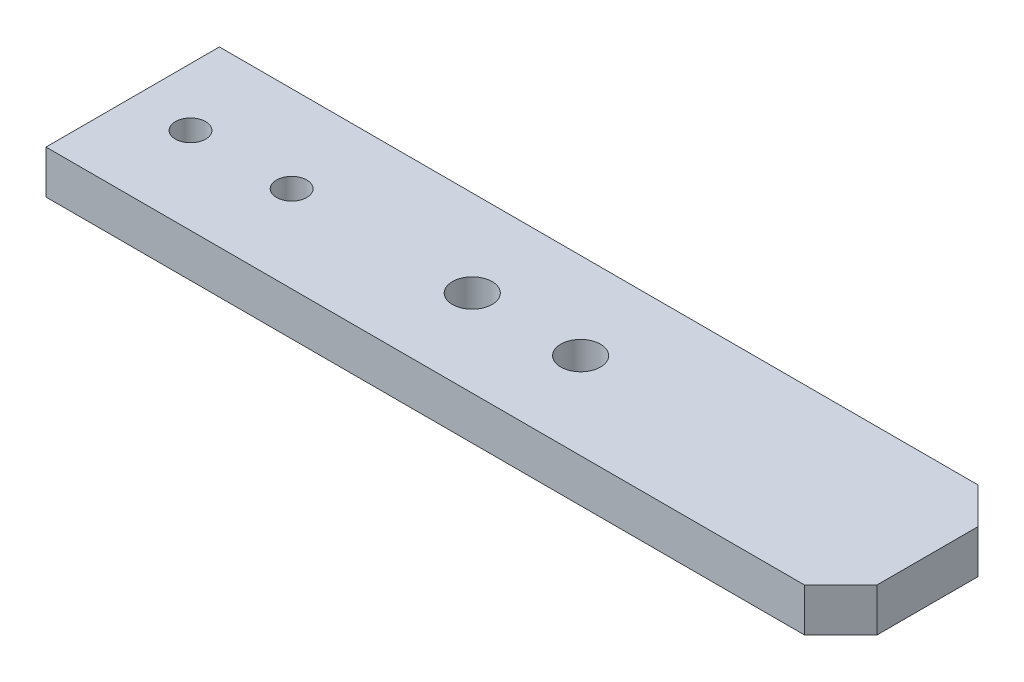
from build123d import *

# Parameters (mm, degrees)
SKETCH1_R         = 2.75
EXTRUDE1_DEPTH    = 6
M5_TAPPED_HOLE1_D = 4.2


with BuildPart() as part:
    # Sketch1 → Extrude1 (new body)
    with BuildSketch(Plane(origin=(0, 0, 0), x_dir=(1, 0, 0), z_dir=(0, 1, 0))):
        Polygon((0, 0), (105, 0), (110, 5), (110, 19), (105, 24), (0, 24), align=None)
        with Locations(Location((47, 12, 0), (0, 0, 270))):
            Circle(SKETCH1_R, mode=Mode.SUBTRACT)
        with Locations(Location((62, 12, 0), (0, 0, 270))):
            Circle(SKETCH1_R, mode=Mode.SUBTRACT)
    extrude(amount=EXTRUDE1_DEPTH)

    # M5 Tapped Hole1 (through all)
    with Locations(Plane(origin=(8, 6, -12), x_dir=(0, 0, 1), z_dir=(0, 1, 0))):
        with Locations((0, 0), (0, 14)):
            Hole(M5_TAPPED_HOLE1_D / 2)


solid = part.part
